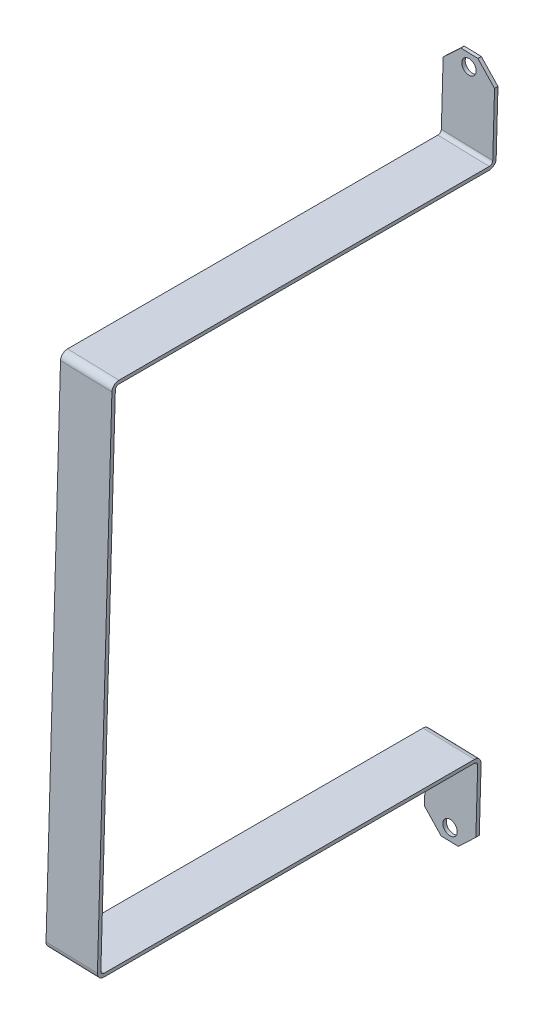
from build123d import *

# Parameters (mm, degrees)
EXTRUSION1_DEPTH        = 7.5
ESQUISSE3_R             = 2.1
ENL_V_MAT_EXTRU_1_DEPTH = 324.876258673
CHANFREIN1_SIZE         = 5


with BuildPart() as part:
    # Esquisse2 → Extrusion1 (new, symmetric)
    with BuildSketch(Plane(origin=(-273.729106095, 7.765908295, 0), x_dir=(0.0283593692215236, 0.9995977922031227, 1.980029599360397e-15), z_dir=(0.9995977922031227, -0.0283593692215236, 0))):
        with BuildLine():
            Line((77.5, 0), (101, 0))
            Line((101, 0), (101, 1))
            Line((101, 1), (77.5, 1))
            ThreePointArc((77.5, 1), (76.792893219, 1.292893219), (76.5, 2))
            Line((76.5, 2), (76.5, 110))
            ThreePointArc((76.5, 110), (75.914213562, 111.414213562), (74.5, 112))
            Line((74.5, 112), (-74.5, 112))
            ThreePointArc((-74.5, 112), (-75.914213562, 111.414213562), (-76.5, 110))
            Line((-76.5, 110), (-76.5, 2))
            ThreePointArc((-76.5, 2), (-76.792893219, 1.292893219), (-77.5, 1))
            Line((-77.5, 1), (-101, 1))
            Line((-101, 1), (-101, 0))
            Line((-101, 0), (-77.5, 0))
            ThreePointArc((-77.5, 0), (-76.085786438, 0.585786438), (-75.5, 2))
            Line((-75.5, 2), (-75.5, 110))
            ThreePointArc((-75.5, 110), (-75.207106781, 110.707106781), (-74.5, 111))
            Line((-74.5, 111), (74.5, 111))
            ThreePointArc((74.5, 111), (75.207106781, 110.707106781), (75.5, 110))
            Line((75.5, 110), (75.5, 2))
            ThreePointArc((75.5, 2), (76.085786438, 0.585786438), (77.5, 0))
        make_face()
    extrude(amount=EXTRUSION1_DEPTH, both=True)

    # Esquisse3 → Enl_v. mat.-Extru.1 (cut, through all)
    with BuildSketch(Plane.XY.offset(1)):
        with Locations((-276.494144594, -89.694876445)):
            Circle(ESQUISSE3_R)
        with Locations((-270.964067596, 105.226693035)):
            Circle(ESQUISSE3_R)
    extrude(amount=-ENL_V_MAT_EXTRU_1_DEPTH, mode=Mode.SUBTRACT)

    # Chanfrein1
    chanfrein1_edges = [part.edges().sort_by_distance(p)[0] for p in [
        (-284.090385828, -92.980773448, 0.5),
        (-278.361793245, 108.937980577, 0.5),
        (-269.096418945, -93.406163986, 0.5),
        (-263.367826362, 108.512590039, 0.5),
    ]]
    chamfer(chanfrein1_edges, length=CHANFREIN1_SIZE)


solid = part.part
